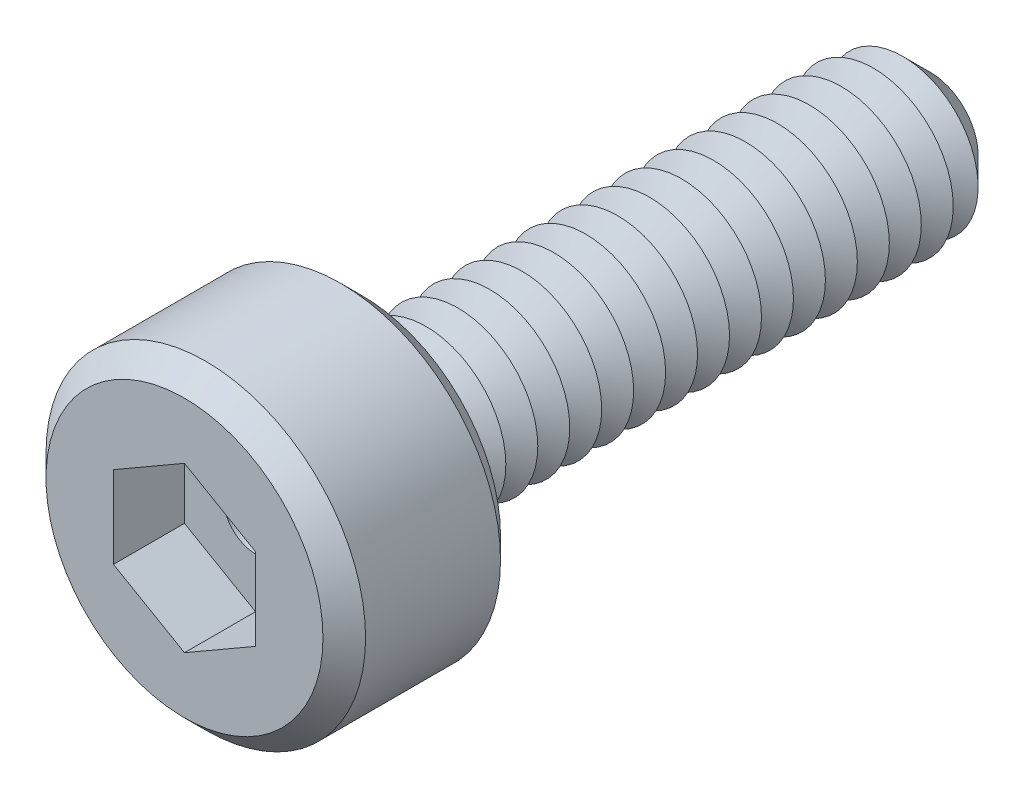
from build123d import *

# Parameters (mm, degrees)
SKETCH1_R           = 2.25
BOSS_EXTRUDE1_DEPTH = 2.5
SKETCH2_R           = 1.125
BOSS_EXTRUDE2_DEPTH = 8
CHAMFER1_SIZE       = 0.45
LPATTERN1_COUNT     = 17
LPATTERN1_PITCH     = 0.45
CUT_EXTRUDE1_DEPTH  = 1
SKETCH6_R           = 0.45
CUT_EXTRUDE2_DEPTH  = 9.5
CHAMFER2_SIZE       = 0.3


with BuildPart() as part:
    # Sketch1 → Boss-Extrude1 (new body)
    with BuildSketch(Plane.XY):
        Circle(SKETCH1_R)
    extrude(amount=BOSS_EXTRUDE1_DEPTH)

    # Sketch2 → Boss-Extrude2 (add)
    with BuildSketch(Plane(origin=(0, 0, 0), x_dir=(-1, 0, 0), z_dir=(0, 0, -1))):
        Circle(SKETCH2_R)
    extrude(amount=BOSS_EXTRUDE2_DEPTH)

    # Chamfer1
    chamfer1_edges = [part.edges().sort_by_distance(p)[0] for p in [
        (1.125, 0, -8),
    ]]
    chamfer(chamfer1_edges, length=CHAMFER1_SIZE)

    # Sketch4 → Cut-Revolve1 (revolve, cut)
    with BuildSketch(Plane(origin=(0, 0, 0), x_dir=(0, 0, -1), z_dir=(1, 0, 0)), mode=Mode.PRIVATE) as cut_revolve1_sk:
        Polygon((0, 1.125), (0.225, 0.735288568), (0.45, 1.125), align=None)
    cut_revolve1 = revolve(cut_revolve1_sk.sketch.rotate(Axis((0, 0, 2.512122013), (0, 0, -1)), 90), axis=Axis((0, 0, 2.512122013), (0, 0, -1)), mode=Mode.SUBTRACT)

    # LPattern1: Cut-Revolve1 ×17
    with Locations(*[(0, 0, -i * LPATTERN1_PITCH) for i in range(1, LPATTERN1_COUNT)]):
        add(cut_revolve1, mode=Mode.SUBTRACT)

    # Sketch5 → Cut-Extrude1 (cut)
    with BuildSketch(Plane.XY.offset(2.5)):
        Polygon((0, 1.154700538), (-1, 0.577350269), (-1, -0.577350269), (0, -1.154700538), (1, -0.577350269), (1, 0.577350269), align=None)
    extrude(amount=-CUT_EXTRUDE1_DEPTH, mode=Mode.SUBTRACT)

    # Sketch6 → Cut-Extrude2 (cut)
    with BuildSketch(Plane.XY.offset(1.5)):
        Circle(SKETCH6_R)
    extrude(amount=-CUT_EXTRUDE2_DEPTH, mode=Mode.SUBTRACT)

    # Chamfer2
    chamfer2_edges = [part.edges().sort_by_distance(p)[0] for p in [
        (-2.25, 0, 0),
        (-2.25, 0, 2.5),
    ]]
    chamfer(chamfer2_edges, length=CHAMFER2_SIZE)


solid = part.part
